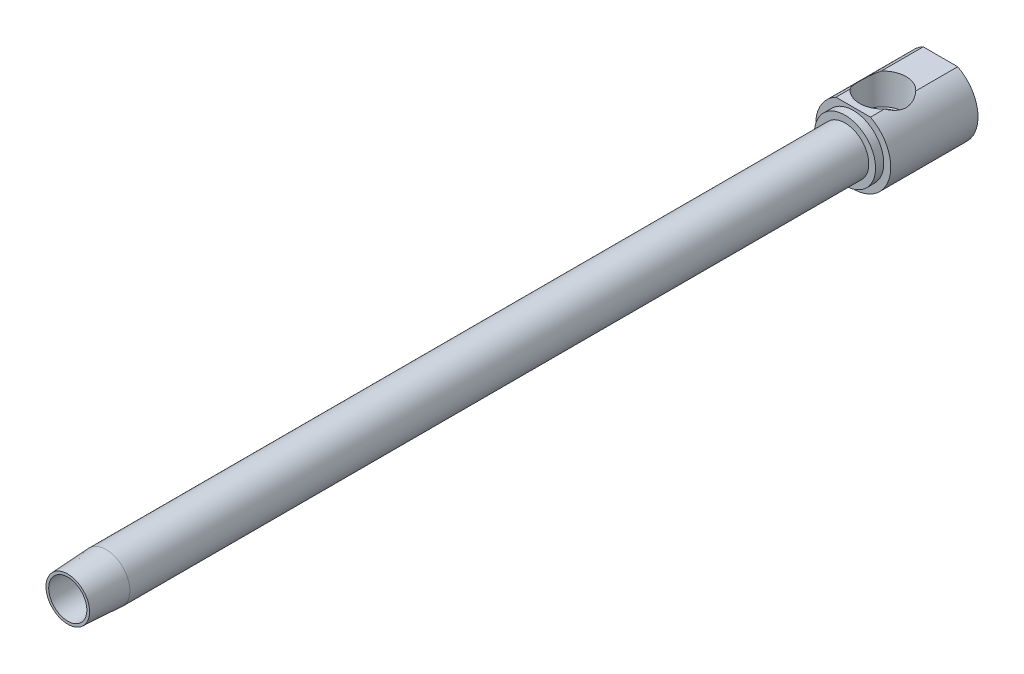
ISO-10303-21;
HEADER;
FILE_DESCRIPTION(('STEP AP214'),'2;1');
FILE_NAME('part.step','',(''),(''),'','','');
FILE_SCHEMA(('AUTOMOTIVE_DESIGN { 1 0 10303 214 1 1 1 1 }'));
ENDSEC;
DATA;
#1=APPLICATION_CONTEXT('core data for automotive mechanical design processes');
#2=APPLICATION_PROTOCOL_DEFINITION('international standard','automotive_design',2000,#1);
#3=PRODUCT_CONTEXT('',#1,'mechanical');
#4=PRODUCT('Part','Part','',(#3));
#5=PRODUCT_RELATED_PRODUCT_CATEGORY('part','',(#4));
#6=PRODUCT_DEFINITION_FORMATION('','',#4);
#7=PRODUCT_DEFINITION_CONTEXT('part definition',#1,'design');
#8=PRODUCT_DEFINITION('design','',#6,#7);
#9=PRODUCT_DEFINITION_SHAPE('','',#8);
#10=(LENGTH_UNIT() NAMED_UNIT(*) SI_UNIT(.MILLI.,.METRE.));
#11=(NAMED_UNIT(*) PLANE_ANGLE_UNIT() SI_UNIT($,.RADIAN.));
#12=(NAMED_UNIT(*) SI_UNIT($,.STERADIAN.) SOLID_ANGLE_UNIT());
#13=UNCERTAINTY_MEASURE_WITH_UNIT(LENGTH_MEASURE(1.E-05),#10,'distance_accuracy_value','');
#14=(GEOMETRIC_REPRESENTATION_CONTEXT(3) GLOBAL_UNCERTAINTY_ASSIGNED_CONTEXT((#13)) GLOBAL_UNIT_ASSIGNED_CONTEXT((#10,
#11,#12)) REPRESENTATION_CONTEXT('',''));
#15=CARTESIAN_POINT('',(0.,0.,0.));
#16=DIRECTION('',(0.,0.,1.));
#17=DIRECTION('',(1.,0.,0.));
#18=AXIS2_PLACEMENT_3D('',#15,#16,#17);
#19=CARTESIAN_POINT('',(0.,0.,-287.922166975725));
#20=DIRECTION('',(0.,0.,-1.));
#21=DIRECTION('',(-1.,0.,0.));
#22=AXIS2_PLACEMENT_3D('',#19,#20,#21);
#23=CYLINDRICAL_SURFACE('',#22,6.9215);
#24=CARTESIAN_POINT('',(0.,0.,-11.1472000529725));
#25=DIRECTION('',(0.,0.,-1.));
#26=DIRECTION('',(-1.,0.,0.));
#27=AXIS2_PLACEMENT_3D('',#24,#25,#26);
#28=CIRCLE('',#27,6.9215);
#29=CARTESIAN_POINT('',(-6.9215,0.,-11.1472000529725));
#30=VERTEX_POINT('',#29);
#31=EDGE_CURVE('E260',#30,#30,#28,.T.);
#32=ORIENTED_EDGE('',*,*,#31,.T.);
#33=EDGE_LOOP('',(#32));
#34=FACE_BOUND('',#33,.T.);
#35=CARTESIAN_POINT('',(0.,0.,-226.2124));
#36=DIRECTION('',(0.,0.,-1.));
#37=DIRECTION('',(-1.,0.,0.));
#38=AXIS2_PLACEMENT_3D('',#35,#36,#37);
#39=CIRCLE('',#38,6.9215);
#40=CARTESIAN_POINT('',(-6.9215,0.,-226.2124));
#41=VERTEX_POINT('',#40);
#42=EDGE_CURVE('E230',#41,#41,#39,.T.);
#43=ORIENTED_EDGE('',*,*,#42,.F.);
#44=EDGE_LOOP('',(#43));
#45=FACE_BOUND('',#44,.T.);
#46=ADVANCED_FACE('F15',(#34,#45),#23,.T.);
#47=CARTESIAN_POINT('',(-5.0165,9.70179425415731,-212.725));
#48=DIRECTION('',(0.,-1.,0.));
#49=DIRECTION('',(0.,0.,-1.));
#50=AXIS2_PLACEMENT_3D('',#47,#48,#49);
#51=PLANE('',#50);
#52=DIRECTION('',(0.,0.,-1.));
#53=VECTOR('',#52,1.);
#54=CARTESIAN_POINT('',(5.0165,9.70179425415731,-212.725));
#55=LINE('',#54,#53);
#56=CARTESIAN_POINT('',(5.0165,9.70179425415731,-228.6));
#57=VERTEX_POINT('',#56);
#58=CARTESIAN_POINT('',(5.0165,9.70179425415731,-232.680663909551));
#59=VERTEX_POINT('',#58);
#60=EDGE_CURVE('E222',#57,#59,#55,.T.);
#61=ORIENTED_EDGE('',*,*,#60,.T.);
#62=CARTESIAN_POINT('',(0.,9.70179425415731,-237.236));
#63=DIRECTION('',(0.,-1.,0.));
#64=DIRECTION('',(0.,0.,-1.));
#65=AXIS2_PLACEMENT_3D('',#62,#63,#64);
#66=CIRCLE('',#65,6.77616109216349);
#67=CARTESIAN_POINT('',(-5.0165,9.70179425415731,-232.680663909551));
#68=VERTEX_POINT('',#67);
#69=EDGE_CURVE('E10',#59,#68,#66,.T.);
#70=ORIENTED_EDGE('',*,*,#69,.T.);
#71=DIRECTION('',(0.,0.,-1.));
#72=VECTOR('',#71,1.);
#73=CARTESIAN_POINT('',(-5.0165,9.70179425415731,-212.725));
#74=LINE('',#73,#72);
#75=CARTESIAN_POINT('',(-5.0165,9.70179425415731,-228.6));
#76=VERTEX_POINT('',#75);
#77=EDGE_CURVE('E229',#76,#68,#74,.T.);
#78=ORIENTED_EDGE('',*,*,#77,.F.);
#79=DIRECTION('',(1.,0.,0.));
#80=VECTOR('',#79,1.);
#81=CARTESIAN_POINT('',(-8.89,9.70179425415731,-228.6));
#82=LINE('',#81,#80);
#83=EDGE_CURVE('E192',#76,#57,#82,.T.);
#84=ORIENTED_EDGE('',*,*,#83,.T.);
#85=EDGE_LOOP('',(#61,#70,#78,#84));
#86=FACE_BOUND('',#85,.T.);
#87=ADVANCED_FACE('F128',(#86),#51,.F.);
#88=CARTESIAN_POINT('',(-5.55625,0.,-226.187));
#89=DIRECTION('',(0.,0.,1.));
#90=DIRECTION('',(1.,0.,0.));
#91=AXIS2_PLACEMENT_3D('',#88,#89,#90);
#92=PLANE('',#91);
#93=CARTESIAN_POINT('',(0.,0.,-226.187));
#94=DIRECTION('',(0.,0.,-1.));
#95=DIRECTION('',(-1.,0.,0.));
#96=AXIS2_PLACEMENT_3D('',#93,#94,#95);
#97=CIRCLE('',#96,5.55625);
#98=CARTESIAN_POINT('',(-5.55625,0.,-226.187));
#99=VERTEX_POINT('',#98);
#100=EDGE_CURVE('E243',#99,#99,#97,.T.);
#101=ORIENTED_EDGE('',*,*,#100,.F.);
#102=EDGE_LOOP('',(#101));
#103=FACE_BOUND('',#102,.T.);
#104=CARTESIAN_POINT('',(0.,-0.00757924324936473,-226.187));
#105=DIRECTION('',(0.,0.,1.));
#106=DIRECTION('',(0.,1.,0.));
#107=AXIS2_PLACEMENT_3D('',#104,#105,#106);
#108=ELLIPSE('',#107,5.22919092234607,4.47866855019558);
#109=CARTESIAN_POINT('',(0.,5.22161167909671,-226.187));
#110=VERTEX_POINT('',#109);
#111=EDGE_CURVE('E193',#110,#110,#108,.F.);
#112=ORIENTED_EDGE('',*,*,#111,.T.);
#113=EDGE_LOOP('',(#112));
#114=FACE_BOUND('',#113,.T.);
#115=ADVANCED_FACE('F134',(#103,#114),#92,.T.);
#116=CARTESIAN_POINT('',(-5.55625,0.,0.));
#117=DIRECTION('',(0.,0.,1.));
#118=DIRECTION('',(1.,0.,0.));
#119=AXIS2_PLACEMENT_3D('',#116,#117,#118);
#120=PLANE('',#119);
#121=CARTESIAN_POINT('',(0.,0.,0.));
#122=DIRECTION('',(0.,0.,-1.));
#123=DIRECTION('',(-1.,0.,0.));
#124=AXIS2_PLACEMENT_3D('',#121,#122,#123);
#125=CIRCLE('',#124,6.3373);
#126=CARTESIAN_POINT('',(-6.3373,0.,0.));
#127=VERTEX_POINT('',#126);
#128=EDGE_CURVE('E257',#127,#127,#125,.T.);
#129=ORIENTED_EDGE('',*,*,#128,.F.);
#130=EDGE_LOOP('',(#129));
#131=FACE_BOUND('',#130,.T.);
#132=CARTESIAN_POINT('',(0.,0.,0.));
#133=DIRECTION('',(0.,0.,-1.));
#134=DIRECTION('',(-1.,0.,0.));
#135=AXIS2_PLACEMENT_3D('',#132,#133,#134);
#136=CIRCLE('',#135,5.55625);
#137=CARTESIAN_POINT('',(-5.55625,0.,0.));
#138=VERTEX_POINT('',#137);
#139=EDGE_CURVE('E19',#138,#138,#136,.T.);
#140=ORIENTED_EDGE('',*,*,#139,.T.);
#141=EDGE_LOOP('',(#140));
#142=FACE_BOUND('',#141,.T.);
#143=ADVANCED_FACE('F17',(#131,#142),#120,.T.);
#144=CARTESIAN_POINT('',(0.,0.,-287.922166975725));
#145=DIRECTION('',(0.,0.,-1.));
#146=DIRECTION('',(-1.,0.,0.));
#147=AXIS2_PLACEMENT_3D('',#144,#145,#146);
#148=CYLINDRICAL_SURFACE('',#147,5.55625);
#149=ORIENTED_EDGE('',*,*,#100,.T.);
#150=EDGE_LOOP('',(#149));
#151=FACE_BOUND('',#150,.T.);
#152=ORIENTED_EDGE('',*,*,#139,.F.);
#153=EDGE_LOOP('',(#152));
#154=FACE_BOUND('',#153,.T.);
#155=ADVANCED_FACE('F141',(#151,#154),#148,.F.);
#156=CARTESIAN_POINT('',(-10.922,0.,-254.));
#157=DIRECTION('',(0.,0.,-1.));
#158=DIRECTION('',(-1.,0.,0.));
#159=AXIS2_PLACEMENT_3D('',#156,#157,#158);
#160=PLANE('',#159);
#161=DIRECTION('',(1.,0.,0.));
#162=VECTOR('',#161,1.);
#163=CARTESIAN_POINT('',(-2.7496306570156,4.7625,-254.));
#164=LINE('',#163,#162);
#165=CARTESIAN_POINT('',(-2.7496306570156,4.7625,-254.));
#166=VERTEX_POINT('',#165);
#167=CARTESIAN_POINT('',(2.7496306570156,4.7625,-254.));
#168=VERTEX_POINT('',#167);
#169=EDGE_CURVE('E353',#166,#168,#164,.T.);
#170=ORIENTED_EDGE('',*,*,#169,.F.);
#171=DIRECTION('',(0.5,0.866025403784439,0.));
#172=VECTOR('',#171,1.);
#173=CARTESIAN_POINT('',(-5.49926131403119,0.,-254.));
#174=LINE('',#173,#172);
#175=CARTESIAN_POINT('',(-5.49926131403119,0.,-254.));
#176=VERTEX_POINT('',#175);
#177=EDGE_CURVE('E338',#176,#166,#174,.T.);
#178=ORIENTED_EDGE('',*,*,#177,.F.);
#179=DIRECTION('',(-0.5,0.866025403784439,0.));
#180=VECTOR('',#179,1.);
#181=CARTESIAN_POINT('',(-2.7496306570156,-4.7625,-254.));
#182=LINE('',#181,#180);
#183=CARTESIAN_POINT('',(-2.7496306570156,-4.7625,-254.));
#184=VERTEX_POINT('',#183);
#185=EDGE_CURVE('E342',#184,#176,#182,.T.);
#186=ORIENTED_EDGE('',*,*,#185,.F.);
#187=DIRECTION('',(-1.,0.,0.));
#188=VECTOR('',#187,1.);
#189=CARTESIAN_POINT('',(2.74963065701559,-4.7625,-254.));
#190=LINE('',#189,#188);
#191=CARTESIAN_POINT('',(2.74963065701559,-4.7625,-254.));
#192=VERTEX_POINT('',#191);
#193=EDGE_CURVE('E361',#192,#184,#190,.T.);
#194=ORIENTED_EDGE('',*,*,#193,.F.);
#195=DIRECTION('',(-0.5,-0.866025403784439,0.));
#196=VECTOR('',#195,1.);
#197=CARTESIAN_POINT('',(5.49926131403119,0.,-254.));
#198=LINE('',#197,#196);
#199=CARTESIAN_POINT('',(5.49926131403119,0.,-254.));
#200=VERTEX_POINT('',#199);
#201=EDGE_CURVE('E358',#200,#192,#198,.T.);
#202=ORIENTED_EDGE('',*,*,#201,.F.);
#203=DIRECTION('',(0.5,-0.866025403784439,0.));
#204=VECTOR('',#203,1.);
#205=CARTESIAN_POINT('',(2.7496306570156,4.7625,-254.));
#206=LINE('',#205,#204);
#207=EDGE_CURVE('E355',#168,#200,#206,.T.);
#208=ORIENTED_EDGE('',*,*,#207,.F.);
#209=EDGE_LOOP('',(#170,#178,#186,#194,#202,#208));
#210=FACE_BOUND('',#209,.T.);
#211=DIRECTION('',(-1.,0.,0.));
#212=VECTOR('',#211,1.);
#213=CARTESIAN_POINT('',(-5.0165,9.70179425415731,-254.));
#214=LINE('',#213,#212);
#215=CARTESIAN_POINT('',(5.0165,9.70179425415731,-254.));
#216=VERTEX_POINT('',#215);
#217=CARTESIAN_POINT('',(-5.0165,9.70179425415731,-254.));
#218=VERTEX_POINT('',#217);
#219=EDGE_CURVE('E223',#216,#218,#214,.T.);
#220=ORIENTED_EDGE('',*,*,#219,.F.);
#221=CARTESIAN_POINT('',(0.,0.,-254.));
#222=DIRECTION('',(0.,0.,-1.));
#223=DIRECTION('',(-1.,0.,0.));
#224=AXIS2_PLACEMENT_3D('',#221,#222,#223);
#225=CIRCLE('',#224,10.922);
#226=EDGE_CURVE('E221',#216,#218,#225,.T.);
#227=ORIENTED_EDGE('',*,*,#226,.T.);
#228=EDGE_LOOP('',(#220,#227));
#229=FACE_BOUND('',#228,.T.);
#230=ADVANCED_FACE('F144',(#210,#229),#160,.T.);
#231=CARTESIAN_POINT('',(0.,0.,-287.922166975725));
#232=DIRECTION('',(0.,0.,-1.));
#233=DIRECTION('',(-1.,0.,0.));
#234=AXIS2_PLACEMENT_3D('',#231,#232,#233);
#235=CYLINDRICAL_SURFACE('',#234,10.922);
#236=CARTESIAN_POINT('',(5.01611318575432,9.70199425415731,-232.680222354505));
#237=CARTESIAN_POINT('',(5.13874600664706,9.63860171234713,-232.820215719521));
#238=CARTESIAN_POINT('',(5.25564164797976,9.57520664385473,-232.965256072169));
#239=CARTESIAN_POINT('',(5.47752086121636,9.45002813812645,-233.264981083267));
#240=CARTESIAN_POINT('',(5.58249714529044,9.38824570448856,-233.419671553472));
#241=CARTESIAN_POINT('',(5.78097274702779,9.26736711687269,-233.739725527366));
#242=CARTESIAN_POINT('',(5.8743418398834,9.20830544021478,-233.90518303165));
#243=CARTESIAN_POINT('',(6.04766375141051,9.09541327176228,-234.244678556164));
#244=CARTESIAN_POINT('',(6.12761848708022,9.04158203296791,-234.418715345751));
#245=CARTESIAN_POINT('',(6.27379640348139,8.94077724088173,-234.775643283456));
#246=CARTESIAN_POINT('',(6.33993919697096,8.89384428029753,-234.958579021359));
#247=CARTESIAN_POINT('',(6.45706504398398,8.80917858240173,-235.331294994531));
#248=CARTESIAN_POINT('',(6.50805163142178,8.7714437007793,-235.521073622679));
#249=CARTESIAN_POINT('',(6.59383346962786,8.70714156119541,-235.905114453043));
#250=CARTESIAN_POINT('',(6.62870831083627,8.6805194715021,-236.099349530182));
#251=CARTESIAN_POINT('',(6.68193856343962,8.63961377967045,-236.491343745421));
#252=CARTESIAN_POINT('',(6.70029794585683,8.6253272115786,-236.689102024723));
#253=CARTESIAN_POINT('',(6.71863048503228,8.61105017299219,-237.05650037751));
#254=CARTESIAN_POINT('',(6.72092722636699,8.6092532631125,-237.225959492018));
#255=CARTESIAN_POINT('',(6.71322085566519,8.61526418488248,-237.564414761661));
#256=CARTESIAN_POINT('',(6.70321892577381,8.62307109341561,-237.733410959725));
#257=CARTESIAN_POINT('',(6.67106070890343,8.64797346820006,-238.069752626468));
#258=CARTESIAN_POINT('',(6.64888985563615,8.66508006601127,-238.237095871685));
#259=CARTESIAN_POINT('',(6.59274566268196,8.70787088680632,-238.568631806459));
#260=CARTESIAN_POINT('',(6.55877214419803,8.73355523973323,-238.732824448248));
#261=CARTESIAN_POINT('',(6.44503992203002,8.81817206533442,-239.197696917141));
#262=CARTESIAN_POINT('',(6.35112179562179,8.88662503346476,-239.493302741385));
#263=CARTESIAN_POINT('',(6.12702756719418,9.04257250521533,-240.064869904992));
#264=CARTESIAN_POINT('',(5.99683851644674,9.13007380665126,-240.340824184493));
#265=CARTESIAN_POINT('',(5.73165005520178,9.2982747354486,-240.818944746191));
#266=CARTESIAN_POINT('',(5.60244827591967,9.37701803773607,-241.025061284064));
#267=CARTESIAN_POINT('',(5.32402625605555,9.53785679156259,-241.420821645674));
#268=CARTESIAN_POINT('',(5.17487070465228,9.61994083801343,-241.610515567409));
#269=CARTESIAN_POINT('',(5.01611318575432,9.70199425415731,-241.791777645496));
#270=B_SPLINE_CURVE_WITH_KNOTS('',3,(#236,#237,#238,#239,#240,#241,#242,#243,#244,#245,#246,
#247,#248,#249,#250,#251,#252,#253,#254,#255,#256,#257,#258,#259,#260,#261,#262,#263,#264,#265,
#266,#267,#268,#269),.UNSPECIFIED.,.F.,.F.,(4,2,2,2,2,2,2,2,2,2,2,2,2,2,2,2,4),(0.,
0.589708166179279,1.17977497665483,1.77595731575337,2.37205438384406,2.97152964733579,
3.57086502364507,4.16720722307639,4.76340599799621,5.27115701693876,5.77885923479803,
6.28717050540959,6.7954894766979,7.74447500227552,8.69379975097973,9.4595634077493,
10.222902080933),.UNSPECIFIED.);
#271=CARTESIAN_POINT('',(5.0165,9.70179425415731,-241.79133609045));
#272=VERTEX_POINT('',#271);
#273=EDGE_CURVE('E31',#59,#272,#270,.T.);
#274=ORIENTED_EDGE('',*,*,#273,.F.);
#275=ORIENTED_EDGE('',*,*,#60,.F.);
#276=CARTESIAN_POINT('',(0.,0.,-228.6));
#277=DIRECTION('',(0.,0.,-1.));
#278=DIRECTION('',(-1.,0.,0.));
#279=AXIS2_PLACEMENT_3D('',#276,#277,#278);
#280=CIRCLE('',#279,10.922);
#281=EDGE_CURVE('E239',#57,#76,#280,.T.);
#282=ORIENTED_EDGE('',*,*,#281,.T.);
#283=ORIENTED_EDGE('',*,*,#77,.T.);
#284=CARTESIAN_POINT('',(-5.01611318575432,9.70199425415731,-241.791777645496));
#285=CARTESIAN_POINT('',(-5.13874600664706,9.63860171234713,-241.651784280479));
#286=CARTESIAN_POINT('',(-5.25564164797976,9.57520664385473,-241.506743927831));
#287=CARTESIAN_POINT('',(-5.47752086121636,9.45002813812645,-241.207018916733));
#288=CARTESIAN_POINT('',(-5.58249714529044,9.38824570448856,-241.052328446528));
#289=CARTESIAN_POINT('',(-5.78097274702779,9.26736711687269,-240.732274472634));
#290=CARTESIAN_POINT('',(-5.8743418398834,9.20830544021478,-240.56681696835));
#291=CARTESIAN_POINT('',(-6.04766375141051,9.09541327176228,-240.227321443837));
#292=CARTESIAN_POINT('',(-6.12761848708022,9.04158203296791,-240.053284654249));
#293=CARTESIAN_POINT('',(-6.27379640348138,8.94077724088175,-239.696356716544));
#294=CARTESIAN_POINT('',(-6.33993919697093,8.89384428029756,-239.513420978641));
#295=CARTESIAN_POINT('',(-6.45706504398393,8.80917858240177,-239.140705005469));
#296=CARTESIAN_POINT('',(-6.50805163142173,8.77144370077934,-238.950926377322));
#297=CARTESIAN_POINT('',(-6.5938334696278,8.70714156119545,-238.566885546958));
#298=CARTESIAN_POINT('',(-6.62870831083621,8.68051947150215,-238.372650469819));
#299=CARTESIAN_POINT('',(-6.68193856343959,8.63961377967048,-237.98065625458));
#300=CARTESIAN_POINT('',(-6.70029794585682,8.62532721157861,-237.782897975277));
#301=CARTESIAN_POINT('',(-6.71863048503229,8.61105017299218,-237.41549962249));
#302=CARTESIAN_POINT('',(-6.720927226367,8.6092532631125,-237.246040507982));
#303=CARTESIAN_POINT('',(-6.7132208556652,8.61526418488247,-236.90758523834));
#304=CARTESIAN_POINT('',(-6.70321892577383,8.62307109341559,-236.738589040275));
#305=CARTESIAN_POINT('',(-6.67106070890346,8.64797346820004,-236.402247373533));
#306=CARTESIAN_POINT('',(-6.64888985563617,8.66508006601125,-236.234904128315));
#307=CARTESIAN_POINT('',(-6.59274566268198,8.70787088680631,-235.903368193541));
#308=CARTESIAN_POINT('',(-6.55877214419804,8.73355523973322,-235.739175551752));
#309=CARTESIAN_POINT('',(-6.44503992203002,8.81817206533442,-235.274303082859));
#310=CARTESIAN_POINT('',(-6.35112179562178,8.88662503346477,-234.978697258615));
#311=CARTESIAN_POINT('',(-6.12702756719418,9.04257250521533,-234.407130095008));
#312=CARTESIAN_POINT('',(-5.99683851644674,9.13007380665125,-234.131175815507));
#313=CARTESIAN_POINT('',(-5.73165005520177,9.2982747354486,-233.653055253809));
#314=CARTESIAN_POINT('',(-5.60244827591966,9.37701803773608,-233.446938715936));
#315=CARTESIAN_POINT('',(-5.32402625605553,9.5378567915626,-233.051178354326));
#316=CARTESIAN_POINT('',(-5.17487070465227,9.61994083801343,-232.861484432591));
#317=CARTESIAN_POINT('',(-5.01611318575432,9.70199425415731,-232.680222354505));
#318=B_SPLINE_CURVE_WITH_KNOTS('',3,(#284,#285,#286,#287,#288,#289,#290,#291,#292,#293,#294,
#295,#296,#297,#298,#299,#300,#301,#302,#303,#304,#305,#306,#307,#308,#309,#310,#311,#312,#313,
#314,#315,#316,#317),.UNSPECIFIED.,.F.,.F.,(4,2,2,2,2,2,2,2,2,2,2,2,2,2,2,2,4),(0.,
0.589708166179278,1.17977497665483,1.77595731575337,2.37205438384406,2.97152964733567,
3.57086502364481,4.16720722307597,4.76340599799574,5.27115701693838,5.77885923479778,
6.28717050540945,6.7954894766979,7.74447500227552,8.69379975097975,9.45956340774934,
10.222902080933),.UNSPECIFIED.);
#319=CARTESIAN_POINT('',(-5.0165,9.70179425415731,-241.79133609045));
#320=VERTEX_POINT('',#319);
#321=EDGE_CURVE('E161',#320,#68,#318,.T.);
#322=ORIENTED_EDGE('',*,*,#321,.F.);
#323=EDGE_CURVE('E215',#320,#218,#74,.T.);
#324=ORIENTED_EDGE('',*,*,#323,.T.);
#325=ORIENTED_EDGE('',*,*,#226,.F.);
#326=EDGE_CURVE('E213',#272,#216,#55,.T.);
#327=ORIENTED_EDGE('',*,*,#326,.F.);
#328=EDGE_LOOP('',(#274,#275,#282,#283,#322,#324,#325,#327));
#329=FACE_BOUND('',#328,.T.);
#330=ADVANCED_FACE('F151',(#329),#235,.T.);
#331=CARTESIAN_POINT('',(-8.89,0.,-228.6));
#332=DIRECTION('',(0.,0.,1.));
#333=DIRECTION('',(1.,0.,0.));
#334=AXIS2_PLACEMENT_3D('',#331,#332,#333);
#335=PLANE('',#334);
#336=ORIENTED_EDGE('',*,*,#83,.F.);
#337=ORIENTED_EDGE('',*,*,#281,.F.);
#338=EDGE_LOOP('',(#336,#337));
#339=FACE_BOUND('',#338,.T.);
#340=CARTESIAN_POINT('',(0.,0.,-228.6));
#341=DIRECTION('',(0.,0.,-1.));
#342=DIRECTION('',(-1.,0.,0.));
#343=AXIS2_PLACEMENT_3D('',#340,#341,#342);
#344=CIRCLE('',#343,8.89);
#345=CARTESIAN_POINT('',(-8.89,0.,-228.6));
#346=VERTEX_POINT('',#345);
#347=EDGE_CURVE('E236',#346,#346,#344,.T.);
#348=ORIENTED_EDGE('',*,*,#347,.T.);
#349=EDGE_LOOP('',(#348));
#350=FACE_BOUND('',#349,.T.);
#351=ADVANCED_FACE('F156',(#339,#350),#335,.T.);
#352=CARTESIAN_POINT('',(0.,0.,-287.922166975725));
#353=DIRECTION('',(0.,0.,-1.));
#354=DIRECTION('',(-1.,0.,0.));
#355=AXIS2_PLACEMENT_3D('',#352,#353,#354);
#356=CYLINDRICAL_SURFACE('',#355,8.89);
#357=CARTESIAN_POINT('',(0.,0.,-226.2124));
#358=DIRECTION('',(0.,0.,-1.));
#359=DIRECTION('',(-1.,0.,0.));
#360=AXIS2_PLACEMENT_3D('',#357,#358,#359);
#361=CIRCLE('',#360,8.89);
#362=CARTESIAN_POINT('',(-8.89,0.,-226.2124));
#363=VERTEX_POINT('',#362);
#364=EDGE_CURVE('E233',#363,#363,#361,.T.);
#365=ORIENTED_EDGE('',*,*,#364,.T.);
#366=EDGE_LOOP('',(#365));
#367=FACE_BOUND('',#366,.T.);
#368=ORIENTED_EDGE('',*,*,#347,.F.);
#369=EDGE_LOOP('',(#368));
#370=FACE_BOUND('',#369,.T.);
#371=ADVANCED_FACE('F282',(#367,#370),#356,.T.);
#372=CARTESIAN_POINT('',(-6.9215,0.,-226.2124));
#373=DIRECTION('',(0.,0.,1.));
#374=DIRECTION('',(1.,0.,0.));
#375=AXIS2_PLACEMENT_3D('',#372,#373,#374);
#376=PLANE('',#375);
#377=ORIENTED_EDGE('',*,*,#42,.T.);
#378=EDGE_LOOP('',(#377));
#379=FACE_BOUND('',#378,.T.);
#380=ORIENTED_EDGE('',*,*,#364,.F.);
#381=EDGE_LOOP('',(#380));
#382=FACE_BOUND('',#381,.T.);
#383=ADVANCED_FACE('F286',(#379,#382),#376,.T.);
#384=ORIENTED_EDGE('',*,*,#323,.F.);
#385=EDGE_CURVE('E24',#320,#272,#66,.T.);
#386=ORIENTED_EDGE('',*,*,#385,.T.);
#387=ORIENTED_EDGE('',*,*,#326,.T.);
#388=ORIENTED_EDGE('',*,*,#219,.T.);
#389=EDGE_LOOP('',(#384,#386,#387,#388));
#390=FACE_BOUND('',#389,.T.);
#391=ADVANCED_FACE('F137',(#390),#51,.F.);
#392=CARTESIAN_POINT('',(-2.7496306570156,4.7625,-247.65));
#393=DIRECTION('',(0.,1.,0.));
#394=DIRECTION('',(0.,0.,1.));
#395=AXIS2_PLACEMENT_3D('',#392,#393,#394);
#396=PLANE('',#395);
#397=ORIENTED_EDGE('',*,*,#169,.T.);
#398=DIRECTION('',(0.,0.,-1.));
#399=VECTOR('',#398,1.);
#400=CARTESIAN_POINT('',(2.7496306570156,4.7625,-247.65));
#401=LINE('',#400,#399);
#402=CARTESIAN_POINT('',(2.7496306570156,4.7625,-247.65));
#403=VERTEX_POINT('',#402);
#404=EDGE_CURVE('E352',#403,#168,#401,.T.);
#405=ORIENTED_EDGE('',*,*,#404,.F.);
#406=DIRECTION('',(1.,0.,0.));
#407=VECTOR('',#406,1.);
#408=CARTESIAN_POINT('',(-2.7496306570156,4.7625,-247.65));
#409=LINE('',#408,#407);
#410=CARTESIAN_POINT('',(-2.7496306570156,4.7625,-247.65));
#411=VERTEX_POINT('',#410);
#412=EDGE_CURVE('E331',#411,#403,#409,.T.);
#413=ORIENTED_EDGE('',*,*,#412,.F.);
#414=DIRECTION('',(0.,0.,-1.));
#415=VECTOR('',#414,1.);
#416=CARTESIAN_POINT('',(-2.7496306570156,4.7625,-247.65));
#417=LINE('',#416,#415);
#418=EDGE_CURVE('E225',#411,#166,#417,.T.);
#419=ORIENTED_EDGE('',*,*,#418,.T.);
#420=EDGE_LOOP('',(#397,#405,#413,#419));
#421=FACE_BOUND('',#420,.T.);
#422=ADVANCED_FACE('F296',(#421),#396,.F.);
#423=CARTESIAN_POINT('',(-5.49926131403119,0.,-247.65));
#424=DIRECTION('',(-0.866025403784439,0.5,0.));
#425=DIRECTION('',(-0.5,-0.866025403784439,0.));
#426=AXIS2_PLACEMENT_3D('',#423,#424,#425);
#427=PLANE('',#426);
#428=ORIENTED_EDGE('',*,*,#177,.T.);
#429=ORIENTED_EDGE('',*,*,#418,.F.);
#430=DIRECTION('',(0.5,0.866025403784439,0.));
#431=VECTOR('',#430,1.);
#432=CARTESIAN_POINT('',(-5.49926131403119,0.,-247.65));
#433=LINE('',#432,#431);
#434=CARTESIAN_POINT('',(-5.49926131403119,0.,-247.65));
#435=VERTEX_POINT('',#434);
#436=EDGE_CURVE('E337',#435,#411,#433,.T.);
#437=ORIENTED_EDGE('',*,*,#436,.F.);
#438=DIRECTION('',(0.,0.,-1.));
#439=VECTOR('',#438,1.);
#440=CARTESIAN_POINT('',(-5.49926131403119,0.,-247.65));
#441=LINE('',#440,#439);
#442=EDGE_CURVE('E367',#435,#176,#441,.T.);
#443=ORIENTED_EDGE('',*,*,#442,.T.);
#444=EDGE_LOOP('',(#428,#429,#437,#443));
#445=FACE_BOUND('',#444,.T.);
#446=ADVANCED_FACE('F299',(#445),#427,.F.);
#447=CARTESIAN_POINT('',(-2.7496306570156,-4.7625,-247.65));
#448=DIRECTION('',(-0.866025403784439,-0.5,0.));
#449=DIRECTION('',(0.5,-0.866025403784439,0.));
#450=AXIS2_PLACEMENT_3D('',#447,#448,#449);
#451=PLANE('',#450);
#452=ORIENTED_EDGE('',*,*,#185,.T.);
#453=ORIENTED_EDGE('',*,*,#442,.F.);
#454=DIRECTION('',(-0.5,0.866025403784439,0.));
#455=VECTOR('',#454,1.);
#456=CARTESIAN_POINT('',(-2.7496306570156,-4.7625,-247.65));
#457=LINE('',#456,#455);
#458=CARTESIAN_POINT('',(-2.7496306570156,-4.7625,-247.65));
#459=VERTEX_POINT('',#458);
#460=EDGE_CURVE('E349',#459,#435,#457,.T.);
#461=ORIENTED_EDGE('',*,*,#460,.F.);
#462=DIRECTION('',(0.,0.,-1.));
#463=VECTOR('',#462,1.);
#464=CARTESIAN_POINT('',(-2.7496306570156,-4.7625,-247.65));
#465=LINE('',#464,#463);
#466=EDGE_CURVE('E369',#459,#184,#465,.T.);
#467=ORIENTED_EDGE('',*,*,#466,.T.);
#468=EDGE_LOOP('',(#452,#453,#461,#467));
#469=FACE_BOUND('',#468,.T.);
#470=ADVANCED_FACE('F313',(#469),#451,.F.);
#471=CARTESIAN_POINT('',(2.74963065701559,-4.7625,-247.65));
#472=DIRECTION('',(0.,-1.,0.));
#473=DIRECTION('',(1.,0.,0.));
#474=AXIS2_PLACEMENT_3D('',#471,#472,#473);
#475=PLANE('',#474);
#476=ORIENTED_EDGE('',*,*,#193,.T.);
#477=ORIENTED_EDGE('',*,*,#466,.F.);
#478=DIRECTION('',(-1.,0.,0.));
#479=VECTOR('',#478,1.);
#480=CARTESIAN_POINT('',(2.74963065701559,-4.7625,-247.65));
#481=LINE('',#480,#479);
#482=CARTESIAN_POINT('',(2.74963065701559,-4.7625,-247.65));
#483=VERTEX_POINT('',#482);
#484=EDGE_CURVE('E346',#483,#459,#481,.T.);
#485=ORIENTED_EDGE('',*,*,#484,.F.);
#486=DIRECTION('',(0.,0.,-1.));
#487=VECTOR('',#486,1.);
#488=CARTESIAN_POINT('',(2.74963065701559,-4.7625,-247.65));
#489=LINE('',#488,#487);
#490=EDGE_CURVE('E371',#483,#192,#489,.T.);
#491=ORIENTED_EDGE('',*,*,#490,.T.);
#492=EDGE_LOOP('',(#476,#477,#485,#491));
#493=FACE_BOUND('',#492,.T.);
#494=ADVANCED_FACE('F309',(#493),#475,.F.);
#495=CARTESIAN_POINT('',(5.49926131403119,0.,-247.65));
#496=DIRECTION('',(0.866025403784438,-0.5,0.));
#497=DIRECTION('',(0.5,0.866025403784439,0.));
#498=AXIS2_PLACEMENT_3D('',#495,#496,#497);
#499=PLANE('',#498);
#500=ORIENTED_EDGE('',*,*,#201,.T.);
#501=ORIENTED_EDGE('',*,*,#490,.F.);
#502=DIRECTION('',(-0.5,-0.866025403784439,0.));
#503=VECTOR('',#502,1.);
#504=CARTESIAN_POINT('',(5.49926131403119,0.,-247.65));
#505=LINE('',#504,#503);
#506=CARTESIAN_POINT('',(5.49926131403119,0.,-247.65));
#507=VERTEX_POINT('',#506);
#508=EDGE_CURVE('E339',#507,#483,#505,.T.);
#509=ORIENTED_EDGE('',*,*,#508,.F.);
#510=DIRECTION('',(0.,0.,-1.));
#511=VECTOR('',#510,1.);
#512=CARTESIAN_POINT('',(5.49926131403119,0.,-247.65));
#513=LINE('',#512,#511);
#514=EDGE_CURVE('E373',#507,#200,#513,.T.);
#515=ORIENTED_EDGE('',*,*,#514,.T.);
#516=EDGE_LOOP('',(#500,#501,#509,#515));
#517=FACE_BOUND('',#516,.T.);
#518=ADVANCED_FACE('F305',(#517),#499,.F.);
#519=CARTESIAN_POINT('',(2.7496306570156,4.7625,-247.65));
#520=DIRECTION('',(0.866025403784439,0.5,0.));
#521=DIRECTION('',(-0.5,0.866025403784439,0.));
#522=AXIS2_PLACEMENT_3D('',#519,#520,#521);
#523=PLANE('',#522);
#524=ORIENTED_EDGE('',*,*,#207,.T.);
#525=ORIENTED_EDGE('',*,*,#514,.F.);
#526=DIRECTION('',(0.5,-0.866025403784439,0.));
#527=VECTOR('',#526,1.);
#528=CARTESIAN_POINT('',(2.7496306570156,4.7625,-247.65));
#529=LINE('',#528,#527);
#530=EDGE_CURVE('E334',#403,#507,#529,.T.);
#531=ORIENTED_EDGE('',*,*,#530,.F.);
#532=ORIENTED_EDGE('',*,*,#404,.T.);
#533=EDGE_LOOP('',(#524,#525,#531,#532));
#534=FACE_BOUND('',#533,.T.);
#535=ADVANCED_FACE('F301',(#534),#523,.F.);
#536=CARTESIAN_POINT('',(0.,0.,-247.65));
#537=DIRECTION('',(0.,0.,-1.));
#538=DIRECTION('',(-1.,0.,0.));
#539=AXIS2_PLACEMENT_3D('',#536,#537,#538);
#540=PLANE('',#539);
#541=ORIENTED_EDGE('',*,*,#412,.T.);
#542=ORIENTED_EDGE('',*,*,#530,.T.);
#543=ORIENTED_EDGE('',*,*,#508,.T.);
#544=ORIENTED_EDGE('',*,*,#484,.T.);
#545=ORIENTED_EDGE('',*,*,#460,.T.);
#546=ORIENTED_EDGE('',*,*,#436,.T.);
#547=EDGE_LOOP('',(#541,#542,#543,#544,#545,#546));
#548=FACE_BOUND('',#547,.T.);
#549=ADVANCED_FACE('F304',(#548),#540,.T.);
#550=CARTESIAN_POINT('',(0.,-6.20347480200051,-235.570096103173));
#551=DIRECTION('',(0.,0.499512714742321,0.866306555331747));
#552=DIRECTION('',(0.,-0.866306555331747,0.499512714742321));
#553=AXIS2_PLACEMENT_3D('',#550,#551,#552);
#554=CONICAL_SURFACE('',#553,1.6057813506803,1.04663497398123);
#555=CARTESIAN_POINT('',(-1.60598135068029,-4.92366652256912,-235.992483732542));
#556=CARTESIAN_POINT('',(-1.54801586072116,-4.95680342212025,-236.01140561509));
#557=CARTESIAN_POINT('',(-1.48993744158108,-4.9898023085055,-236.030231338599));
#558=CARTESIAN_POINT('',(-1.37340604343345,-5.05537021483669,-236.067594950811));
#559=CARTESIAN_POINT('',(-1.31495289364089,-5.08793901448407,-236.086132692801));
#560=CARTESIAN_POINT('',(-1.19585116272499,-5.1534103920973,-236.123346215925));
#561=CARTESIAN_POINT('',(-1.13518864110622,-5.18629452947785,-236.142009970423));
#562=CARTESIAN_POINT('',(-1.01316854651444,-5.25107049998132,-236.178708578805));
#563=CARTESIAN_POINT('',(-0.951811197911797,-5.28296264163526,-236.196743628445));
#564=CARTESIAN_POINT('',(-0.839118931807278,-5.3396112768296,-236.228707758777));
#565=CARTESIAN_POINT('',(-0.78795756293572,-5.36462261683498,-236.242793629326));
#566=CARTESIAN_POINT('',(-0.684623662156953,-5.41302356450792,-236.269993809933));
#567=CARTESIAN_POINT('',(-0.632451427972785,-5.43641364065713,-236.283108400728));
#568=CARTESIAN_POINT('',(-0.527211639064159,-5.48038053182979,-236.307701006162));
#569=CARTESIAN_POINT('',(-0.474159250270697,-5.50098432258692,-236.319194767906));
#570=CARTESIAN_POINT('',(-0.366152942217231,-5.53798897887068,-236.339788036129));
#571=CARTESIAN_POINT('',(-0.311202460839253,-5.55439703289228,-236.34889163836));
#572=CARTESIAN_POINT('',(-0.22440451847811,-5.57453509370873,-236.360044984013));
#573=CARTESIAN_POINT('',(-0.193292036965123,-5.58064728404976,-236.363425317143));
#574=CARTESIAN_POINT('',(-0.130548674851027,-5.59030484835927,-236.368762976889));
#575=CARTESIAN_POINT('',(-0.0989180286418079,-5.59385135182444,-236.370720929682));
#576=CARTESIAN_POINT('',(-0.0355632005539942,-5.59800285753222,-236.373012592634));
#577=CARTESIAN_POINT('',(-0.00384036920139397,-5.59862312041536,-236.373354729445));
#578=CARTESIAN_POINT('',(0.0594996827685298,-5.59689784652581,-236.372402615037));
#579=CARTESIAN_POINT('',(0.091116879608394,-5.59455168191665,-236.371108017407));
#580=CARTESIAN_POINT('',(0.198837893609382,-5.58181842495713,-236.364074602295));
#581=CARTESIAN_POINT('',(0.273911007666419,-5.56473069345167,-236.354627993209));
#582=CARTESIAN_POINT('',(0.384150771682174,-5.53190562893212,-236.336402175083));
#583=CARTESIAN_POINT('',(0.4208880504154,-5.51959035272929,-236.329553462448));
#584=CARTESIAN_POINT('',(0.493546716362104,-5.49323102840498,-236.314866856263));
#585=CARTESIAN_POINT('',(0.529468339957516,-5.47918748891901,-236.307029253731));
#586=CARTESIAN_POINT('',(0.612782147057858,-5.44486829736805,-236.287841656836));
#587=CARTESIAN_POINT('',(0.659900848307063,-5.42410253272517,-236.27620641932));
#588=CARTESIAN_POINT('',(0.753260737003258,-5.38113317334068,-236.25207919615));
#589=CARTESIAN_POINT('',(0.799501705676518,-5.35892922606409,-236.239587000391));
#590=CARTESIAN_POINT('',(0.937391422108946,-5.29083562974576,-236.201207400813));
#591=CARTESIAN_POINT('',(1.02808532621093,-5.24351779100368,-236.174446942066));
#592=CARTESIAN_POINT('',(1.20042119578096,-5.1511102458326,-236.12204965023));
#593=CARTESIAN_POINT('',(1.28217710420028,-5.1061732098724,-236.096510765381));
#594=CARTESIAN_POINT('',(1.40412884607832,-5.03811359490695,-236.05776330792));
#595=CARTESIAN_POINT('',(1.44460336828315,-5.01535392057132,-236.044794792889));
#596=CARTESIAN_POINT('',(1.52539869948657,-4.96964276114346,-236.018728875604));
#597=CARTESIAN_POINT('',(1.56571951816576,-4.94669128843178,-236.005631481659));
#598=CARTESIAN_POINT('',(1.60598135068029,-4.92366652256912,-235.992483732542));
#599=B_SPLINE_CURVE_WITH_KNOTS('',3,(#555,#556,#557,#558,#559,#560,#561,#562,#563,#564,#565,
#566,#567,#568,#569,#570,#571,#572,#573,#574,#575,#576,#577,#578,#579,#580,#581,#582,#583,#584,
#585,#586,#587,#588,#589,#590,#591,#592,#593,#594,#595,#596,#597,#598),.UNSPECIFIED.,.F.,.F.,(4,
2,2,2,2,2,2,2,2,2,2,2,2,2,2,2,2,2,2,2,2,4),(0.,0.208197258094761,0.41649731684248,
0.63093488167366,0.845305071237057,1.02127406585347,1.19719199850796,1.37126163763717,
1.54503101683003,1.64057868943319,1.73608427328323,1.83109123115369,1.92611830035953,
2.15701869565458,2.27506343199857,2.39307350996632,2.55139683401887,2.70975911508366,
3.02689190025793,3.31705802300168,3.46169224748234,3.6063172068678),.UNSPECIFIED.);
#600=CARTESIAN_POINT('',(-1.11098322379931,-5.19906341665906,-236.149240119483));
#601=VERTEX_POINT('',#600);
#602=CARTESIAN_POINT('',(1.11098322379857,-5.19906341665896,-236.149240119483));
#603=VERTEX_POINT('',#602);
#604=EDGE_CURVE('E269',#601,#603,#599,.T.);
#605=ORIENTED_EDGE('',*,*,#604,.F.);
#606=CARTESIAN_POINT('',(0.,-6.20347480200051,-235.570096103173));
#607=DIRECTION('',(0.,-0.499512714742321,-0.866306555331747));
#608=DIRECTION('',(0.,0.866306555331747,-0.499512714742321));
#609=AXIS2_PLACEMENT_3D('',#606,#607,#608);
#610=CIRCLE('',#609,1.6057813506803);
#611=EDGE_CURVE('E172',#603,#601,#610,.T.);
#612=ORIENTED_EDGE('',*,*,#611,.F.);
#613=EDGE_LOOP('',(#605,#612));
#614=FACE_BOUND('',#613,.T.);
#615=CARTESIAN_POINT('',(0.,-6.66717404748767,-236.374291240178));
#616=VERTEX_POINT('',#615);
#617=VERTEX_LOOP('',#616);
#618=FACE_BOUND('',#617,.T.);
#619=ADVANCED_FACE('F123',(#614,#618),#554,.F.);
#620=CARTESIAN_POINT('',(0.,0.737834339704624,-223.531760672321));
#621=DIRECTION('',(0.,0.499512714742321,0.866306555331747));
#622=DIRECTION('',(0.,-0.866306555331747,0.499512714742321));
#623=AXIS2_PLACEMENT_3D('',#620,#621,#622);
#624=CONICAL_SURFACE('',#623,5.22642714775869,0.254883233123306);
#625=CARTESIAN_POINT('',(1.01196113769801,-5.32825795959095,-236.372404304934));
#626=CARTESIAN_POINT('',(1.03389680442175,-5.30065791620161,-236.324478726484));
#627=CARTESIAN_POINT('',(1.05540462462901,-5.27289731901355,-236.276452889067));
#628=CARTESIAN_POINT('',(1.09769940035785,-5.21711231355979,-236.180240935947));
#629=CARTESIAN_POINT('',(1.11848639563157,-5.18908791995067,-236.132054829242));
#630=CARTESIAN_POINT('',(1.1799640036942,-5.10471123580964,-235.98732712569));
#631=CARTESIAN_POINT('',(1.21977960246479,-5.0480447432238,-235.890597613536));
#632=CARTESIAN_POINT('',(1.29773817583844,-4.93416916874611,-235.696847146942));
#633=CARTESIAN_POINT('',(1.33588180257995,-4.87696030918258,-235.599826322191));
#634=CARTESIAN_POINT('',(1.4109280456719,-4.76213227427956,-235.405540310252));
#635=CARTESIAN_POINT('',(1.44783058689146,-4.70451307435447,-235.308275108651));
#636=CARTESIAN_POINT('',(1.57544445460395,-4.50218372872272,-234.967289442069));
#637=CARTESIAN_POINT('',(1.66369168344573,-4.35670129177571,-234.723107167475));
#638=CARTESIAN_POINT('',(1.83681407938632,-4.06477004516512,-234.234128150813));
#639=CARTESIAN_POINT('',(1.92168912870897,-3.91832120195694,-233.9893313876));
#640=CARTESIAN_POINT('',(2.08932287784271,-3.62468896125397,-233.499100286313));
#641=CARTESIAN_POINT('',(2.17207941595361,-3.47750498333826,-233.253665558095));
#642=CARTESIAN_POINT('',(2.33601111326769,-3.18275206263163,-232.762542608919));
#643=CARTESIAN_POINT('',(2.41718646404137,-3.03518316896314,-232.516854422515));
#644=CARTESIAN_POINT('',(2.4978920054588,-2.88750711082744,-232.271081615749));
#645=B_SPLINE_CURVE_WITH_KNOTS('',3,(#625,#626,#627,#628,#629,#630,#631,#632,#633,#634,#635,
#636,#637,#638,#639,#640,#641,#642,#643,#644),.UNSPECIFIED.,.F.,.F.,(4,2,2,2,2,2,2,2,2,4),(0.,
0.178483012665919,0.3569561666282,0.713833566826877,1.07057050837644,1.42732900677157,
2.32014264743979,3.21298744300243,4.10670963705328,5.00032286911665),.UNSPECIFIED.);
#646=CARTESIAN_POINT('',(2.49778278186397,-2.88770711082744,-232.271414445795));
#647=VERTEX_POINT('',#646);
#648=EDGE_CURVE('E205',#603,#647,#645,.T.);
#649=ORIENTED_EDGE('',*,*,#648,.F.);
#650=ORIENTED_EDGE('',*,*,#611,.T.);
#651=CARTESIAN_POINT('',(-2.49789200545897,-2.88750711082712,-232.271081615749));
#652=CARTESIAN_POINT('',(-2.44770652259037,-2.97939053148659,-232.423991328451));
#653=CARTESIAN_POINT('',(-2.39731483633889,-3.07122429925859,-232.57686367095));
#654=CARTESIAN_POINT('',(-2.29600007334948,-3.25476046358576,-232.882515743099));
#655=CARTESIAN_POINT('',(-2.2450769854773,-3.34646285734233,-233.035295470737));
#656=CARTESIAN_POINT('',(-2.14254206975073,-3.52977268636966,-233.340858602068));
#657=CARTESIAN_POINT('',(-2.09092972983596,-3.62137998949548,-233.493641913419));
#658=CARTESIAN_POINT('',(-1.98688424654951,-3.80437404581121,-233.79905856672));
#659=CARTESIAN_POINT('',(-1.93445111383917,-3.89576080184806,-233.95169191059));
#660=CARTESIAN_POINT('',(-1.82863256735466,-4.07804970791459,-234.256449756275));
#661=CARTESIAN_POINT('',(-1.77524935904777,-4.16895247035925,-234.408574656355));
#662=CARTESIAN_POINT('',(-1.66707377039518,-4.3503481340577,-234.712567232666));
#663=CARTESIAN_POINT('',(-1.61228140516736,-4.44084103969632,-234.864434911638));
#664=CARTESIAN_POINT('',(-1.50075171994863,-4.62119778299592,-235.167759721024));
#665=CARTESIAN_POINT('',(-1.44401501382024,-4.71106180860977,-235.319216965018));
#666=CARTESIAN_POINT('',(-1.32768795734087,-4.88985939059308,-235.621580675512));
#667=CARTESIAN_POINT('',(-1.26809785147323,-4.97879302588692,-235.772487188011));
#668=CARTESIAN_POINT('',(-1.19073480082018,-5.08895406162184,-235.960524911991));
#669=CARTESIAN_POINT('',(-1.1751187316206,-5.11093553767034,-235.998101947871));
#670=CARTESIAN_POINT('',(-1.14355086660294,-5.15477909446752,-236.073185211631));
#671=CARTESIAN_POINT('',(-1.12759906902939,-5.17664117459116,-236.110691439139));
#672=CARTESIAN_POINT('',(-1.07914810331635,-5.24202332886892,-236.223097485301));
#673=CARTESIAN_POINT('',(-1.04606024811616,-5.28532942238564,-236.29786779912));
#674=CARTESIAN_POINT('',(-1.01196113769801,-5.32825795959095,-236.372404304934));
#675=B_SPLINE_CURVE_WITH_KNOTS('',3,(#651,#652,#653,#654,#655,#656,#657,#658,#659,#660,#661,
#662,#663,#664,#665,#666,#667,#668,#669,#670,#671,#672,#673,#674),.UNSPECIFIED.,.F.,.F.,(4,2,2,
2,2,2,2,2,2,2,2,4),(0.,0.555952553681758,1.11191677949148,1.66831997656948,2.22471595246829,
2.77995563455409,3.33518936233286,3.89024937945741,4.44526192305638,4.58401142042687,
4.72276164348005,5.00032427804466),.UNSPECIFIED.);
#676=CARTESIAN_POINT('',(-2.49778278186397,-2.88770711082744,-232.271414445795));
#677=VERTEX_POINT('',#676);
#678=EDGE_CURVE('E191',#677,#601,#675,.T.);
#679=ORIENTED_EDGE('',*,*,#678,.F.);
#680=CARTESIAN_POINT('',(2.49782755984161,-2.88790711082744,-232.271436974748));
#681=CARTESIAN_POINT('',(2.48383641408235,-2.82542266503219,-232.26439882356));
#682=CARTESIAN_POINT('',(2.46861957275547,-2.76328396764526,-232.256815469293));
#683=CARTESIAN_POINT('',(2.43577104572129,-2.63978050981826,-232.240663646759));
#684=CARTESIAN_POINT('',(2.41813947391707,-2.57841571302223,-232.23209522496));
#685=CARTESIAN_POINT('',(2.36163791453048,-2.39547590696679,-232.205051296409));
#686=CARTESIAN_POINT('',(2.31918902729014,-2.27517998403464,-232.185251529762));
#687=CARTESIAN_POINT('',(2.22428392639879,-2.03745974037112,-232.142737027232));
#688=CARTESIAN_POINT('',(2.17171615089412,-1.92008566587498,-232.119990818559));
#689=CARTESIAN_POINT('',(2.0567047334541,-1.69074876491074,-232.072681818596));
#690=CARTESIAN_POINT('',(1.99426748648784,-1.57878249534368,-232.048120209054));
#691=CARTESIAN_POINT('',(1.8397697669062,-1.3305945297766,-231.991013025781));
#692=CARTESIAN_POINT('',(1.744331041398,-1.19650697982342,-231.958179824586));
#693=CARTESIAN_POINT('',(1.53495715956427,-0.943799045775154,-231.893538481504));
#694=CARTESIAN_POINT('',(1.42109065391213,-0.825124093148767,-231.861727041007));
#695=CARTESIAN_POINT('',(1.20807079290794,-0.640011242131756,-231.810600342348));
#696=CARTESIAN_POINT('',(1.11379707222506,-0.568272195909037,-231.790288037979));
#697=CARTESIAN_POINT('',(0.914761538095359,-0.439859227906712,-231.753351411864));
#698=CARTESIAN_POINT('',(0.810014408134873,-0.383164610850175,-231.736722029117));
#699=CARTESIAN_POINT('',(0.612541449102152,-0.298431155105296,-231.711625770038));
#700=CARTESIAN_POINT('',(0.52142000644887,-0.266968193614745,-231.702201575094));
#701=CARTESIAN_POINT('',(0.334956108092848,-0.21907718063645,-231.687797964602));
#702=CARTESIAN_POINT('',(0.239617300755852,-0.202636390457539,-231.682814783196));
#703=CARTESIAN_POINT('',(0.0470109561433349,-0.186228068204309,-231.677841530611));
#704=CARTESIAN_POINT('',(-0.050262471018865,-0.186322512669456,-231.677870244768));
#705=CARTESIAN_POINT('',(-0.243227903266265,-0.203132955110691,-231.682965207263));
#706=CARTESIAN_POINT('',(-0.338919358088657,-0.219854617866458,-231.68803317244));
#707=CARTESIAN_POINT('',(-0.521251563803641,-0.267164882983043,-231.702259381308));
#708=CARTESIAN_POINT('',(-0.608105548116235,-0.297016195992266,-231.71119980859));
#709=CARTESIAN_POINT('',(-0.776430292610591,-0.368311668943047,-231.732329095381));
#710=CARTESIAN_POINT('',(-0.857899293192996,-0.409759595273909,-231.744519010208));
#711=CARTESIAN_POINT('',(-1.05967586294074,-0.528631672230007,-231.779006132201));
#712=CARTESIAN_POINT('',(-1.17553777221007,-0.613071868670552,-231.803095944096));
#713=CARTESIAN_POINT('',(-1.3921814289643,-0.798819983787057,-231.854518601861));
#714=CARTESIAN_POINT('',(-1.49291384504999,-0.900180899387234,-231.881861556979));
#715=CARTESIAN_POINT('',(-1.65718256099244,-1.08871747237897,-231.930795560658));
#716=CARTESIAN_POINT('',(-1.72379796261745,-1.17332105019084,-231.952162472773));
#717=CARTESIAN_POINT('',(-1.84937081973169,-1.34811375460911,-231.994792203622));
#718=CARTESIAN_POINT('',(-1.90832390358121,-1.43830602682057,-232.01605495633));
#719=CARTESIAN_POINT('',(-2.01897203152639,-1.62326479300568,-232.057846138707));
#720=CARTESIAN_POINT('',(-2.07066203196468,-1.71803440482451,-232.078374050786));
#721=CARTESIAN_POINT('',(-2.16700410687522,-1.91129054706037,-232.118106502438));
#722=CARTESIAN_POINT('',(-2.21165858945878,-2.0097757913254,-232.137311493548));
#723=CARTESIAN_POINT('',(-2.30465900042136,-2.2355271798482,-232.178551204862));
#724=CARTESIAN_POINT('',(-2.35102978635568,-2.36371403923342,-232.200054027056));
#725=CARTESIAN_POINT('',(-2.41232360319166,-2.55862165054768,-232.229281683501));
#726=CARTESIAN_POINT('',(-2.43134086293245,-2.6238640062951,-232.238500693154));
#727=CARTESIAN_POINT('',(-2.4666442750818,-2.75524170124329,-232.255831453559));
#728=CARTESIAN_POINT('',(-2.48292991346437,-2.82137720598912,-232.263942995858));
#729=CARTESIAN_POINT('',(-2.49782755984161,-2.88790711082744,-232.271436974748));
#730=B_SPLINE_CURVE_WITH_KNOTS('',3,(#680,#681,#682,#683,#684,#685,#686,#687,#688,#689,#690,
#691,#692,#693,#694,#695,#696,#697,#698,#699,#700,#701,#702,#703,#704,#705,#706,#707,#708,#709,
#710,#711,#712,#713,#714,#715,#716,#717,#718,#719,#720,#721,#722,#723,#724,#725,#726,#727,#728,
#729),.UNSPECIFIED.,.F.,.F.,(4,2,2,2,2,2,2,2,2,2,2,2,2,2,2,2,2,2,2,2,2,2,2,2,4),(0.,
0.193219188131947,0.386429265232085,0.773233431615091,1.16457552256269,1.55566507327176,
2.05774384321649,2.55799349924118,2.91743960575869,3.27638866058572,3.56577369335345,
3.85491310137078,4.14513627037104,4.43545835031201,4.7112243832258,4.98708008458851,
5.42075552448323,5.85581566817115,6.18473767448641,6.51384652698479,6.84318280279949,
7.17240610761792,7.58580190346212,7.79148391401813,7.99720458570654),.UNSPECIFIED.);
#731=EDGE_CURVE('E185',#647,#677,#730,.T.);
#732=ORIENTED_EDGE('',*,*,#731,.F.);
#733=EDGE_LOOP('',(#649,#650,#679,#732));
#734=FACE_BOUND('',#733,.T.);
#735=ORIENTED_EDGE('',*,*,#111,.F.);
#736=EDGE_LOOP('',(#735));
#737=FACE_BOUND('',#736,.T.);
#738=ADVANCED_FACE('F112',(#734,#737),#624,.F.);
#739=CARTESIAN_POINT('',(0.,-6.09634277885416,-237.236));
#740=DIRECTION('',(0.,1.,0.));
#741=DIRECTION('',(0.,0.,1.));
#742=AXIS2_PLACEMENT_3D('',#739,#740,#741);
#743=CONICAL_SURFACE('',#742,0.,1.0471975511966);
#744=ORIENTED_EDGE('',*,*,#648,.T.);
#745=CARTESIAN_POINT('',(0.,-2.88770711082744,-237.236));
#746=DIRECTION('',(0.,-1.,0.));
#747=DIRECTION('',(0.,0.,-1.));
#748=AXIS2_PLACEMENT_3D('',#745,#746,#747);
#749=CIRCLE('',#748,5.55752);
#750=EDGE_CURVE('E38',#677,#647,#749,.T.);
#751=ORIENTED_EDGE('',*,*,#750,.F.);
#752=ORIENTED_EDGE('',*,*,#678,.T.);
#753=ORIENTED_EDGE('',*,*,#604,.T.);
#754=EDGE_LOOP('',(#744,#751,#752,#753));
#755=FACE_BOUND('',#754,.T.);
#756=CARTESIAN_POINT('',(0.,-6.09634277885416,-237.236));
#757=VERTEX_POINT('',#756);
#758=VERTEX_LOOP('',#757);
#759=FACE_BOUND('',#758,.T.);
#760=ADVANCED_FACE('F109',(#755,#759),#743,.F.);
#761=CARTESIAN_POINT('',(0.,9.70179425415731,-237.236));
#762=DIRECTION('',(0.,-1.,0.));
#763=DIRECTION('',(0.,0.,-1.));
#764=AXIS2_PLACEMENT_3D('',#761,#762,#763);
#765=CYLINDRICAL_SURFACE('',#764,5.55752);
#766=ORIENTED_EDGE('',*,*,#731,.T.);
#767=ORIENTED_EDGE('',*,*,#750,.T.);
#768=EDGE_LOOP('',(#766,#767));
#769=FACE_BOUND('',#768,.T.);
#770=CARTESIAN_POINT('',(0.,0.990599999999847,-237.236));
#771=DIRECTION('',(0.,-1.,0.));
#772=DIRECTION('',(0.,0.,-1.));
#773=AXIS2_PLACEMENT_3D('',#770,#771,#772);
#774=CIRCLE('',#773,5.55752);
#775=CARTESIAN_POINT('',(0.,0.990599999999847,-242.79352));
#776=VERTEX_POINT('',#775);
#777=EDGE_CURVE('E263',#776,#776,#774,.T.);
#778=ORIENTED_EDGE('',*,*,#777,.F.);
#779=EDGE_LOOP('',(#778));
#780=FACE_BOUND('',#779,.T.);
#781=ADVANCED_FACE('F111',(#769,#780),#765,.F.);
#782=CARTESIAN_POINT('',(0.,0.990599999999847,-243.554820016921));
#783=DIRECTION('',(0.,-1.,0.));
#784=DIRECTION('',(0.,0.,-1.));
#785=AXIS2_PLACEMENT_3D('',#782,#783,#784);
#786=PLANE('',#785);
#787=CARTESIAN_POINT('',(0.,0.990599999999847,-237.236));
#788=DIRECTION('',(0.,-1.,0.));
#789=DIRECTION('',(0.,0.,-1.));
#790=AXIS2_PLACEMENT_3D('',#787,#788,#789);
#791=CIRCLE('',#790,6.31882001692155);
#792=CARTESIAN_POINT('',(0.,0.990599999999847,-243.554820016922));
#793=VERTEX_POINT('',#792);
#794=EDGE_CURVE('E259',#793,#793,#791,.T.);
#795=ORIENTED_EDGE('',*,*,#794,.F.);
#796=EDGE_LOOP('',(#795));
#797=FACE_BOUND('',#796,.T.);
#798=ORIENTED_EDGE('',*,*,#777,.T.);
#799=EDGE_LOOP('',(#798));
#800=FACE_BOUND('',#799,.T.);
#801=ADVANCED_FACE('F121',(#797,#800),#786,.F.);
#802=CARTESIAN_POINT('',(0.,0.990599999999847,-237.236));
#803=DIRECTION('',(0.,1.,0.));
#804=DIRECTION('',(0.,0.,1.));
#805=AXIS2_PLACEMENT_3D('',#802,#803,#804);
#806=CONICAL_SURFACE('',#805,6.31882001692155,0.0524522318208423);
#807=ORIENTED_EDGE('',*,*,#273,.T.);
#808=ORIENTED_EDGE('',*,*,#385,.F.);
#809=ORIENTED_EDGE('',*,*,#321,.T.);
#810=ORIENTED_EDGE('',*,*,#69,.F.);
#811=EDGE_LOOP('',(#807,#808,#809,#810));
#812=FACE_BOUND('',#811,.T.);
#813=ORIENTED_EDGE('',*,*,#794,.T.);
#814=EDGE_LOOP('',(#813));
#815=FACE_BOUND('',#814,.T.);
#816=ADVANCED_FACE('F174',(#812,#815),#806,.F.);
#817=CARTESIAN_POINT('',(0.,0.,0.));
#818=DIRECTION('',(0.,0.,-1.));
#819=DIRECTION('',(-1.,0.,0.));
#820=AXIS2_PLACEMENT_3D('',#817,#818,#819);
#821=CONICAL_SURFACE('',#820,6.3373,0.0523598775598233);
#822=ORIENTED_EDGE('',*,*,#31,.F.);
#823=EDGE_LOOP('',(#822));
#824=FACE_BOUND('',#823,.T.);
#825=ORIENTED_EDGE('',*,*,#128,.T.);
#826=EDGE_LOOP('',(#825));
#827=FACE_BOUND('',#826,.T.);
#828=ADVANCED_FACE('F179',(#824,#827),#821,.T.);
#829=CLOSED_SHELL('',(#46,#87,#115,#143,#155,#230,#330,#351,#371,#383,#391,#422,#446,#470,#494,
#518,#535,#549,#619,#738,#760,#781,#801,#816,#828));
#830=MANIFOLD_SOLID_BREP('B1',#829);
#831=ADVANCED_BREP_SHAPE_REPRESENTATION('',(#18,#830),#14);
#832=SHAPE_DEFINITION_REPRESENTATION(#9,#831);
ENDSEC;
END-ISO-10303-21;
